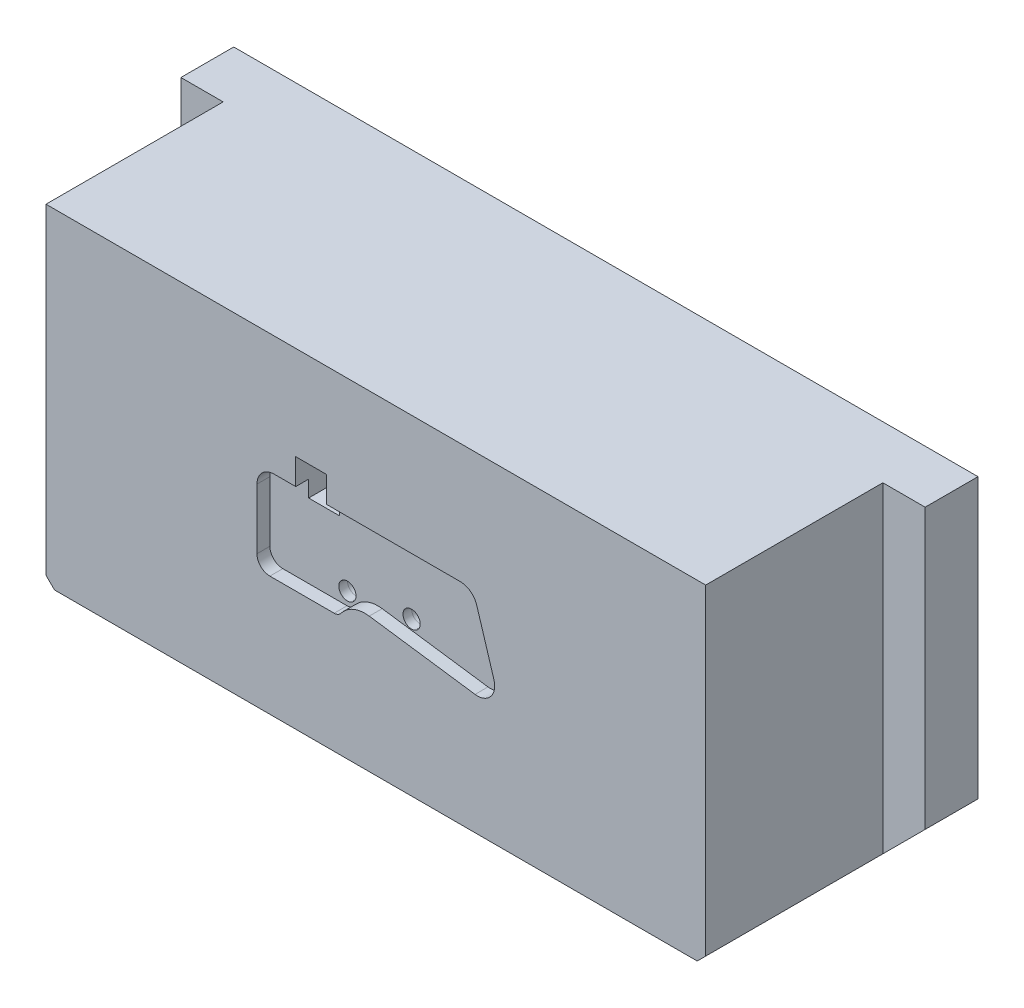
ISO-10303-21;
HEADER;
FILE_DESCRIPTION(('STEP AP214'),'2;1');
FILE_NAME('part.step','',(''),(''),'','','');
FILE_SCHEMA(('AUTOMOTIVE_DESIGN { 1 0 10303 214 1 1 1 1 }'));
ENDSEC;
DATA;
#1=APPLICATION_CONTEXT('core data for automotive mechanical design processes');
#2=APPLICATION_PROTOCOL_DEFINITION('international standard','automotive_design',2000,#1);
#3=PRODUCT_CONTEXT('',#1,'mechanical');
#4=PRODUCT('Part','Part','',(#3));
#5=PRODUCT_RELATED_PRODUCT_CATEGORY('part','',(#4));
#6=PRODUCT_DEFINITION_FORMATION('','',#4);
#7=PRODUCT_DEFINITION_CONTEXT('part definition',#1,'design');
#8=PRODUCT_DEFINITION('design','',#6,#7);
#9=PRODUCT_DEFINITION_SHAPE('','',#8);
#10=(LENGTH_UNIT() NAMED_UNIT(*) SI_UNIT(.MILLI.,.METRE.));
#11=(NAMED_UNIT(*) PLANE_ANGLE_UNIT() SI_UNIT($,.RADIAN.));
#12=(NAMED_UNIT(*) SI_UNIT($,.STERADIAN.) SOLID_ANGLE_UNIT());
#13=UNCERTAINTY_MEASURE_WITH_UNIT(LENGTH_MEASURE(1.E-05),#10,'distance_accuracy_value','');
#14=(GEOMETRIC_REPRESENTATION_CONTEXT(3) GLOBAL_UNCERTAINTY_ASSIGNED_CONTEXT((#13)) GLOBAL_UNIT_ASSIGNED_CONTEXT((#10,
#11,#12)) REPRESENTATION_CONTEXT('',''));
#15=CARTESIAN_POINT('',(0.,0.,0.));
#16=DIRECTION('',(0.,0.,1.));
#17=DIRECTION('',(1.,0.,0.));
#18=AXIS2_PLACEMENT_3D('',#15,#16,#17);
#19=CARTESIAN_POINT('',(-4.8888,-3.819375,-27.2));
#20=DIRECTION('',(0.,0.,1.));
#21=DIRECTION('',(1.,0.,0.));
#22=AXIS2_PLACEMENT_3D('',#19,#20,#21);
#23=CYLINDRICAL_SURFACE('',#22,1.00961168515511);
#24=CARTESIAN_POINT('',(-4.8888,-3.819375,-8.54625));
#25=DIRECTION('',(0.,0.,1.));
#26=DIRECTION('',(1.,0.,0.));
#27=AXIS2_PLACEMENT_3D('',#24,#25,#26);
#28=CIRCLE('',#27,1.00961168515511);
#29=CARTESIAN_POINT('',(-3.87918831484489,-3.819375,-8.54625));
#30=VERTEX_POINT('',#29);
#31=EDGE_CURVE('E33',#30,#30,#28,.F.);
#32=ORIENTED_EDGE('',*,*,#31,.T.);
#33=EDGE_LOOP('',(#32));
#34=FACE_BOUND('',#33,.T.);
#35=CARTESIAN_POINT('',(-4.8888,-3.819375,-2.54625));
#36=DIRECTION('',(0.,0.,1.));
#37=DIRECTION('',(1.,0.,0.));
#38=AXIS2_PLACEMENT_3D('',#35,#36,#37);
#39=CIRCLE('',#38,1.00961168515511);
#40=CARTESIAN_POINT('',(-3.87918831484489,-3.819375,-2.54625));
#41=VERTEX_POINT('',#40);
#42=EDGE_CURVE('E330',#41,#41,#39,.T.);
#43=ORIENTED_EDGE('',*,*,#42,.T.);
#44=EDGE_LOOP('',(#43));
#45=FACE_BOUND('',#44,.T.);
#46=ADVANCED_FACE('F29',(#34,#45),#23,.F.);
#47=CARTESIAN_POINT('',(2.699025,-2.902725,-27.2));
#48=DIRECTION('',(0.,0.,1.));
#49=DIRECTION('',(1.,0.,0.));
#50=AXIS2_PLACEMENT_3D('',#47,#48,#49);
#51=CYLINDRICAL_SURFACE('',#50,1.00961168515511);
#52=CARTESIAN_POINT('',(2.699025,-2.902725,-8.54625));
#53=DIRECTION('',(0.,0.,1.));
#54=DIRECTION('',(1.,0.,0.));
#55=AXIS2_PLACEMENT_3D('',#52,#53,#54);
#56=CIRCLE('',#55,1.00961168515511);
#57=CARTESIAN_POINT('',(3.70863668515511,-2.902725,-8.54625));
#58=VERTEX_POINT('',#57);
#59=EDGE_CURVE('E277',#58,#58,#56,.F.);
#60=ORIENTED_EDGE('',*,*,#59,.T.);
#61=EDGE_LOOP('',(#60));
#62=FACE_BOUND('',#61,.T.);
#63=CARTESIAN_POINT('',(2.699025,-2.902725,-2.54624999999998));
#64=DIRECTION('',(0.,0.,1.));
#65=DIRECTION('',(1.,0.,0.));
#66=AXIS2_PLACEMENT_3D('',#63,#64,#65);
#67=CIRCLE('',#66,1.00961168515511);
#68=CARTESIAN_POINT('',(3.70863668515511,-2.902725,-2.54624999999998));
#69=VERTEX_POINT('',#68);
#70=EDGE_CURVE('E327',#69,#69,#67,.T.);
#71=ORIENTED_EDGE('',*,*,#70,.T.);
#72=EDGE_LOOP('',(#71));
#73=FACE_BOUND('',#72,.T.);
#74=ADVANCED_FACE('F617',(#62,#73),#51,.F.);
#75=CARTESIAN_POINT('',(9.9813,3.310125,-1.52775));
#76=DIRECTION('',(0.,0.,1.));
#77=DIRECTION('',(1.,0.,0.));
#78=AXIS2_PLACEMENT_3D('',#75,#76,#77);
#79=PLANE('',#78);
#80=CARTESIAN_POINT('',(-4.8888,-3.819375,-1.52775));
#81=DIRECTION('',(0.,0.,1.));
#82=DIRECTION('',(1.,0.,0.));
#83=AXIS2_PLACEMENT_3D('',#80,#81,#82);
#84=CIRCLE('',#83,1.0185);
#85=CARTESIAN_POINT('',(-3.8703,-3.819375,-1.52775));
#86=VERTEX_POINT('',#85);
#87=EDGE_CURVE('E354',#86,#86,#84,.F.);
#88=ORIENTED_EDGE('',*,*,#87,.T.);
#89=EDGE_LOOP('',(#88));
#90=FACE_BOUND('',#89,.T.);
#91=DIRECTION('',(0.990268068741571,-0.139173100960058,0.));
#92=VECTOR('',#91,1.);
#93=CARTESIAN_POINT('',(11.7348043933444,-5.32730105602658,-1.52775));
#94=LINE('',#93,#92);
#95=CARTESIAN_POINT('',(-0.778691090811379,-3.56864395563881,-1.52775));
#96=VERTEX_POINT('',#95);
#97=CARTESIAN_POINT('',(11.7348043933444,-5.32730105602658,-1.52775));
#98=VERTEX_POINT('',#97);
#99=EDGE_CURVE('E395',#96,#98,#94,.T.);
#100=ORIENTED_EDGE('',*,*,#99,.T.);
#101=CARTESIAN_POINT('',(12.0183,-3.310125,-1.52775));
#102=DIRECTION('',(0.,0.,1.));
#103=DIRECTION('',(1.,0.,0.));
#104=AXIS2_PLACEMENT_3D('',#101,#102,#103);
#105=CIRCLE('',#104,2.037);
#106=CARTESIAN_POINT('',(13.9652218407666,-2.71107212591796,-1.52775));
#107=VERTEX_POINT('',#106);
#108=EDGE_CURVE('E403',#98,#107,#105,.T.);
#109=ORIENTED_EDGE('',*,*,#108,.T.);
#110=DIRECTION('',(-0.294085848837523,0.95577900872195,0.));
#111=VECTOR('',#110,1.);
#112=CARTESIAN_POINT('',(11.9282218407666,3.90917787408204,-1.52775));
#113=LINE('',#112,#111);
#114=CARTESIAN_POINT('',(11.9282218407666,3.90917787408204,-1.52775));
#115=VERTEX_POINT('',#114);
#116=EDGE_CURVE('E370',#107,#115,#113,.T.);
#117=ORIENTED_EDGE('',*,*,#116,.T.);
#118=CARTESIAN_POINT('',(9.9813,3.310125,-1.52775));
#119=DIRECTION('',(0.,0.,1.));
#120=DIRECTION('',(1.,0.,0.));
#121=AXIS2_PLACEMENT_3D('',#118,#119,#120);
#122=CIRCLE('',#121,2.037);
#123=CARTESIAN_POINT('',(9.9813,5.347125,-1.52775));
#124=VERTEX_POINT('',#123);
#125=EDGE_CURVE('E366',#115,#124,#122,.T.);
#126=ORIENTED_EDGE('',*,*,#125,.T.);
#127=DIRECTION('',(-1.,0.,0.));
#128=VECTOR('',#127,1.);
#129=CARTESIAN_POINT('',(-5.80545,5.347125,-1.52775));
#130=LINE('',#129,#128);
#131=CARTESIAN_POINT('',(-5.80545,5.347125,-1.52775));
#132=VERTEX_POINT('',#131);
#133=EDGE_CURVE('E369',#124,#132,#130,.T.);
#134=ORIENTED_EDGE('',*,*,#133,.T.);
#135=DIRECTION('',(0.,-1.,0.));
#136=VECTOR('',#135,1.);
#137=CARTESIAN_POINT('',(-5.80545,3.411975,-1.52775));
#138=LINE('',#137,#136);
#139=CARTESIAN_POINT('',(-5.80545,3.411975,-1.52775));
#140=VERTEX_POINT('',#139);
#141=EDGE_CURVE('E373',#132,#140,#138,.T.);
#142=ORIENTED_EDGE('',*,*,#141,.T.);
#143=DIRECTION('',(-1.,0.,0.));
#144=VECTOR('',#143,1.);
#145=CARTESIAN_POINT('',(-9.47205,3.411975,-1.52775));
#146=LINE('',#145,#144);
#147=CARTESIAN_POINT('',(-9.47205,3.411975,-1.52775));
#148=VERTEX_POINT('',#147);
#149=EDGE_CURVE('E376',#140,#148,#146,.T.);
#150=ORIENTED_EDGE('',*,*,#149,.T.);
#151=DIRECTION('',(0.,1.,0.));
#152=VECTOR('',#151,1.);
#153=CARTESIAN_POINT('',(-9.47205,5.347125,-1.52775));
#154=LINE('',#153,#152);
#155=CARTESIAN_POINT('',(-9.47205,5.347125,-1.52775));
#156=VERTEX_POINT('',#155);
#157=EDGE_CURVE('E379',#148,#156,#154,.T.);
#158=ORIENTED_EDGE('',*,*,#157,.T.);
#159=DIRECTION('',(-1.,0.,0.));
#160=VECTOR('',#159,1.);
#161=CARTESIAN_POINT('',(-12.0183,5.347125,-1.52775));
#162=LINE('',#161,#160);
#163=CARTESIAN_POINT('',(-12.0183,5.347125,-1.52775));
#164=VERTEX_POINT('',#163);
#165=EDGE_CURVE('E382',#156,#164,#162,.T.);
#166=ORIENTED_EDGE('',*,*,#165,.T.);
#167=CARTESIAN_POINT('',(-12.0183,3.310125,-1.52775));
#168=DIRECTION('',(0.,0.,1.));
#169=DIRECTION('',(1.,0.,0.));
#170=AXIS2_PLACEMENT_3D('',#167,#168,#169);
#171=CIRCLE('',#170,2.037);
#172=CARTESIAN_POINT('',(-14.0553,3.310125,-1.52775));
#173=VERTEX_POINT('',#172);
#174=EDGE_CURVE('E384',#164,#173,#171,.T.);
#175=ORIENTED_EDGE('',*,*,#174,.T.);
#176=DIRECTION('',(0.,-1.,0.));
#177=VECTOR('',#176,1.);
#178=CARTESIAN_POINT('',(-14.0553,3.310125,-1.52775));
#179=LINE('',#178,#177);
#180=CARTESIAN_POINT('',(-14.0553,-3.819375,-1.52775));
#181=VERTEX_POINT('',#180);
#182=EDGE_CURVE('E386',#173,#181,#179,.T.);
#183=ORIENTED_EDGE('',*,*,#182,.T.);
#184=CARTESIAN_POINT('',(-12.52755,-3.819375,-1.52775));
#185=DIRECTION('',(0.,0.,1.));
#186=DIRECTION('',(1.,0.,0.));
#187=AXIS2_PLACEMENT_3D('',#184,#185,#186);
#188=CIRCLE('',#187,1.52775);
#189=CARTESIAN_POINT('',(-12.52755,-5.347125,-1.52775));
#190=VERTEX_POINT('',#189);
#191=EDGE_CURVE('E388',#181,#190,#188,.T.);
#192=ORIENTED_EDGE('',*,*,#191,.T.);
#193=DIRECTION('',(1.,0.,0.));
#194=VECTOR('',#193,1.);
#195=CARTESIAN_POINT('',(-12.52755,-5.347125,-1.52775));
#196=LINE('',#195,#194);
#197=CARTESIAN_POINT('',(-4.9262264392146,-5.347125,-1.52775));
#198=VERTEX_POINT('',#197);
#199=EDGE_CURVE('E392',#190,#198,#196,.T.);
#200=ORIENTED_EDGE('',*,*,#199,.T.);
#201=CARTESIAN_POINT('',(-4.9262264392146,-4.328625,-1.52775));
#202=DIRECTION('',(0.,0.,1.));
#203=DIRECTION('',(1.,0.,0.));
#204=AXIS2_PLACEMENT_3D('',#201,#202,#203);
#205=CIRCLE('',#204,1.0185);
#206=CARTESIAN_POINT('',(-4.11480020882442,-4.94419767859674,-1.52775));
#207=VERTEX_POINT('',#206);
#208=EDGE_CURVE('E394',#198,#207,#205,.T.);
#209=ORIENTED_EDGE('',*,*,#208,.T.);
#210=CARTESIAN_POINT('',(-1.27480840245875,-7.09870205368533,-1.52775));
#211=DIRECTION('',(0.,0.,-1.));
#212=DIRECTION('',(1.,0.,0.));
#213=AXIS2_PLACEMENT_3D('',#210,#211,#212);
#214=CIRCLE('',#213,3.56475);
#215=EDGE_CURVE('E398',#207,#96,#214,.T.);
#216=ORIENTED_EDGE('',*,*,#215,.T.);
#217=EDGE_LOOP('',(#100,#109,#117,#126,#134,#142,#150,#158,#166,#175,#183,#192,#200,#209,#216));
#218=FACE_BOUND('',#217,.T.);
#219=CARTESIAN_POINT('',(2.699025,-2.902725,-1.52775));
#220=DIRECTION('',(0.,0.,1.));
#221=DIRECTION('',(1.,0.,0.));
#222=AXIS2_PLACEMENT_3D('',#219,#220,#221);
#223=CIRCLE('',#222,1.0185);
#224=CARTESIAN_POINT('',(3.717525,-2.902725,-1.52775));
#225=VERTEX_POINT('',#224);
#226=EDGE_CURVE('E391',#225,#225,#223,.F.);
#227=ORIENTED_EDGE('',*,*,#226,.T.);
#228=EDGE_LOOP('',(#227));
#229=FACE_BOUND('',#228,.T.);
#230=ADVANCED_FACE('F623',(#90,#218,#229),#79,.T.);
#231=CARTESIAN_POINT('',(-12.52755,-5.347125,0.));
#232=DIRECTION('',(0.,1.,0.));
#233=DIRECTION('',(-1.,0.,0.));
#234=AXIS2_PLACEMENT_3D('',#231,#232,#233);
#235=PLANE('',#234);
#236=DIRECTION('',(1.,0.,0.));
#237=VECTOR('',#236,1.);
#238=CARTESIAN_POINT('',(-12.52755,-5.347125,0.));
#239=LINE('',#238,#237);
#240=CARTESIAN_POINT('',(-12.52755,-5.347125,0.));
#241=VERTEX_POINT('',#240);
#242=CARTESIAN_POINT('',(-4.9262264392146,-5.347125,0.));
#243=VERTEX_POINT('',#242);
#244=EDGE_CURVE('E424',#241,#243,#239,.T.);
#245=ORIENTED_EDGE('',*,*,#244,.T.);
#246=DIRECTION('',(0.,0.,-1.));
#247=VECTOR('',#246,1.);
#248=CARTESIAN_POINT('',(-4.9262264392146,-5.347125,0.));
#249=LINE('',#248,#247);
#250=EDGE_CURVE('E401',#243,#198,#249,.T.);
#251=ORIENTED_EDGE('',*,*,#250,.T.);
#252=ORIENTED_EDGE('',*,*,#199,.F.);
#253=DIRECTION('',(0.,0.,-1.));
#254=VECTOR('',#253,1.);
#255=CARTESIAN_POINT('',(-12.52755,-5.347125,0.));
#256=LINE('',#255,#254);
#257=EDGE_CURVE('E420',#241,#190,#256,.T.);
#258=ORIENTED_EDGE('',*,*,#257,.F.);
#259=EDGE_LOOP('',(#245,#251,#252,#258));
#260=FACE_BOUND('',#259,.T.);
#261=ADVANCED_FACE('F658',(#260),#235,.T.);
#262=CARTESIAN_POINT('',(11.7348043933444,-5.32730105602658,0.));
#263=DIRECTION('',(0.139173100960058,0.990268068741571,0.));
#264=DIRECTION('',(-0.990268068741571,0.139173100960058,0.));
#265=AXIS2_PLACEMENT_3D('',#262,#263,#264);
#266=PLANE('',#265);
#267=DIRECTION('',(0.,0.,-1.));
#268=VECTOR('',#267,1.);
#269=CARTESIAN_POINT('',(-0.778691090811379,-3.56864395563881,0.));
#270=LINE('',#269,#268);
#271=CARTESIAN_POINT('',(-0.778691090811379,-3.56864395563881,0.));
#272=VERTEX_POINT('',#271);
#273=EDGE_CURVE('E443',#272,#96,#270,.T.);
#274=ORIENTED_EDGE('',*,*,#273,.F.);
#275=DIRECTION('',(0.990268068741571,-0.139173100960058,0.));
#276=VECTOR('',#275,1.);
#277=CARTESIAN_POINT('',(11.7348043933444,-5.32730105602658,0.));
#278=LINE('',#277,#276);
#279=CARTESIAN_POINT('',(11.7348043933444,-5.32730105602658,0.));
#280=VERTEX_POINT('',#279);
#281=EDGE_CURVE('E428',#272,#280,#278,.T.);
#282=ORIENTED_EDGE('',*,*,#281,.T.);
#283=DIRECTION('',(0.,0.,-1.));
#284=VECTOR('',#283,1.);
#285=CARTESIAN_POINT('',(11.7348043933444,-5.32730105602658,0.));
#286=LINE('',#285,#284);
#287=EDGE_CURVE('E416',#280,#98,#286,.T.);
#288=ORIENTED_EDGE('',*,*,#287,.T.);
#289=ORIENTED_EDGE('',*,*,#99,.F.);
#290=EDGE_LOOP('',(#274,#282,#288,#289));
#291=FACE_BOUND('',#290,.T.);
#292=ADVANCED_FACE('F646',(#291),#266,.T.);
#293=CARTESIAN_POINT('',(-39.,19.5,0.));
#294=DIRECTION('',(0.,0.,-1.));
#295=DIRECTION('',(-1.,0.,0.));
#296=AXIS2_PLACEMENT_3D('',#293,#294,#295);
#297=PLANE('',#296);
#298=DIRECTION('',(-1.,0.,0.));
#299=VECTOR('',#298,1.);
#300=CARTESIAN_POINT('',(-39.,19.5,0.));
#301=LINE('',#300,#299);
#302=CARTESIAN_POINT('',(39.,19.5,0.));
#303=VERTEX_POINT('',#302);
#304=CARTESIAN_POINT('',(-39.,19.5,0.));
#305=VERTEX_POINT('',#304);
#306=EDGE_CURVE('E449',#303,#305,#301,.T.);
#307=ORIENTED_EDGE('',*,*,#306,.T.);
#308=DIRECTION('',(0.,-1.,0.));
#309=VECTOR('',#308,1.);
#310=CARTESIAN_POINT('',(-39.,19.5,0.));
#311=LINE('',#310,#309);
#312=CARTESIAN_POINT('',(-39.,-18.5,0.));
#313=VERTEX_POINT('',#312);
#314=EDGE_CURVE('E732',#305,#313,#311,.T.);
#315=ORIENTED_EDGE('',*,*,#314,.T.);
#316=DIRECTION('',(0.707106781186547,-0.707106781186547,0.));
#317=VECTOR('',#316,1.);
#318=CARTESIAN_POINT('',(-39.,-18.5,0.));
#319=LINE('',#318,#317);
#320=CARTESIAN_POINT('',(-38.,-19.5,0.));
#321=VERTEX_POINT('',#320);
#322=EDGE_CURVE('E738',#313,#321,#319,.T.);
#323=ORIENTED_EDGE('',*,*,#322,.T.);
#324=DIRECTION('',(1.,0.,0.));
#325=VECTOR('',#324,1.);
#326=CARTESIAN_POINT('',(-38.,-19.5,0.));
#327=LINE('',#326,#325);
#328=CARTESIAN_POINT('',(38.,-19.5,0.));
#329=VERTEX_POINT('',#328);
#330=EDGE_CURVE('E743',#321,#329,#327,.T.);
#331=ORIENTED_EDGE('',*,*,#330,.T.);
#332=DIRECTION('',(0.707106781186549,0.707106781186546,0.));
#333=VECTOR('',#332,1.);
#334=CARTESIAN_POINT('',(39.,-18.5,0.));
#335=LINE('',#334,#333);
#336=CARTESIAN_POINT('',(39.,-18.5,0.));
#337=VERTEX_POINT('',#336);
#338=EDGE_CURVE('E746',#329,#337,#335,.T.);
#339=ORIENTED_EDGE('',*,*,#338,.T.);
#340=DIRECTION('',(0.,1.,0.));
#341=VECTOR('',#340,1.);
#342=CARTESIAN_POINT('',(39.,19.5,0.));
#343=LINE('',#342,#341);
#344=EDGE_CURVE('E545',#337,#303,#343,.T.);
#345=ORIENTED_EDGE('',*,*,#344,.T.);
#346=EDGE_LOOP('',(#307,#315,#323,#331,#339,#345));
#347=FACE_BOUND('',#346,.T.);
#348=DIRECTION('',(-1.,0.,0.));
#349=VECTOR('',#348,1.);
#350=CARTESIAN_POINT('',(-5.80545,8.411975,0.));
#351=LINE('',#350,#349);
#352=CARTESIAN_POINT('',(-5.80545,8.411975,0.));
#353=VERTEX_POINT('',#352);
#354=CARTESIAN_POINT('',(-9.47205,8.411975,0.));
#355=VERTEX_POINT('',#354);
#356=EDGE_CURVE('E335',#353,#355,#351,.T.);
#357=ORIENTED_EDGE('',*,*,#356,.F.);
#358=DIRECTION('',(0.,1.,0.));
#359=VECTOR('',#358,1.);
#360=CARTESIAN_POINT('',(-5.80545,8.411975,0.));
#361=LINE('',#360,#359);
#362=CARTESIAN_POINT('',(-5.80545,5.347125,0.));
#363=VERTEX_POINT('',#362);
#364=EDGE_CURVE('E333',#363,#353,#361,.T.);
#365=ORIENTED_EDGE('',*,*,#364,.F.);
#366=DIRECTION('',(1.,0.,0.));
#367=VECTOR('',#366,1.);
#368=CARTESIAN_POINT('',(-14.0553,5.347125,0.));
#369=LINE('',#368,#367);
#370=CARTESIAN_POINT('',(9.9813,5.347125,0.));
#371=VERTEX_POINT('',#370);
#372=EDGE_CURVE('E362',#363,#371,#369,.T.);
#373=ORIENTED_EDGE('',*,*,#372,.T.);
#374=CARTESIAN_POINT('',(9.9813,3.310125,0.));
#375=DIRECTION('',(0.,0.,1.));
#376=DIRECTION('',(1.,0.,0.));
#377=AXIS2_PLACEMENT_3D('',#374,#375,#376);
#378=CIRCLE('',#377,2.037);
#379=CARTESIAN_POINT('',(11.9282218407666,3.90917787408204,0.));
#380=VERTEX_POINT('',#379);
#381=EDGE_CURVE('E407',#380,#371,#378,.T.);
#382=ORIENTED_EDGE('',*,*,#381,.F.);
#383=DIRECTION('',(-0.294085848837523,0.95577900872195,0.));
#384=VECTOR('',#383,1.);
#385=CARTESIAN_POINT('',(11.9282218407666,3.90917787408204,0.));
#386=LINE('',#385,#384);
#387=CARTESIAN_POINT('',(13.9652218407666,-2.71107212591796,0.));
#388=VERTEX_POINT('',#387);
#389=EDGE_CURVE('E435',#388,#380,#386,.T.);
#390=ORIENTED_EDGE('',*,*,#389,.F.);
#391=CARTESIAN_POINT('',(12.0183,-3.310125,0.));
#392=DIRECTION('',(0.,0.,1.));
#393=DIRECTION('',(1.,0.,0.));
#394=AXIS2_PLACEMENT_3D('',#391,#392,#393);
#395=CIRCLE('',#394,2.037);
#396=EDGE_CURVE('E430',#280,#388,#395,.T.);
#397=ORIENTED_EDGE('',*,*,#396,.F.);
#398=ORIENTED_EDGE('',*,*,#281,.F.);
#399=CARTESIAN_POINT('',(-1.27480840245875,-7.09870205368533,0.));
#400=DIRECTION('',(0.,0.,-1.));
#401=DIRECTION('',(1.,0.,0.));
#402=AXIS2_PLACEMENT_3D('',#399,#400,#401);
#403=CIRCLE('',#402,3.56475);
#404=CARTESIAN_POINT('',(-4.11480020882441,-4.94419767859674,0.));
#405=VERTEX_POINT('',#404);
#406=EDGE_CURVE('E555',#405,#272,#403,.T.);
#407=ORIENTED_EDGE('',*,*,#406,.F.);
#408=CARTESIAN_POINT('',(-4.9262264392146,-4.328625,0.));
#409=DIRECTION('',(0.,0.,1.));
#410=DIRECTION('',(1.,0.,0.));
#411=AXIS2_PLACEMENT_3D('',#408,#409,#410);
#412=CIRCLE('',#411,1.0185);
#413=EDGE_CURVE('E460',#243,#405,#412,.T.);
#414=ORIENTED_EDGE('',*,*,#413,.F.);
#415=ORIENTED_EDGE('',*,*,#244,.F.);
#416=CARTESIAN_POINT('',(-12.52755,-3.819375,0.));
#417=DIRECTION('',(0.,0.,1.));
#418=DIRECTION('',(1.,0.,0.));
#419=AXIS2_PLACEMENT_3D('',#416,#417,#418);
#420=CIRCLE('',#419,1.52775);
#421=CARTESIAN_POINT('',(-14.0553,-3.819375,0.));
#422=VERTEX_POINT('',#421);
#423=EDGE_CURVE('E421',#422,#241,#420,.T.);
#424=ORIENTED_EDGE('',*,*,#423,.F.);
#425=DIRECTION('',(0.,-1.,0.));
#426=VECTOR('',#425,1.);
#427=CARTESIAN_POINT('',(-14.0553,3.310125,0.));
#428=LINE('',#427,#426);
#429=CARTESIAN_POINT('',(-14.0553,3.310125,0.));
#430=VERTEX_POINT('',#429);
#431=EDGE_CURVE('E417',#430,#422,#428,.T.);
#432=ORIENTED_EDGE('',*,*,#431,.F.);
#433=CARTESIAN_POINT('',(-12.0183,3.310125,0.));
#434=DIRECTION('',(0.,0.,1.));
#435=DIRECTION('',(1.,0.,0.));
#436=AXIS2_PLACEMENT_3D('',#433,#434,#435);
#437=CIRCLE('',#436,2.037);
#438=CARTESIAN_POINT('',(-12.0183,5.347125,0.));
#439=VERTEX_POINT('',#438);
#440=EDGE_CURVE('E412',#439,#430,#437,.T.);
#441=ORIENTED_EDGE('',*,*,#440,.F.);
#442=CARTESIAN_POINT('',(-9.47205,5.347125,0.));
#443=VERTEX_POINT('',#442);
#444=EDGE_CURVE('E365',#439,#443,#369,.T.);
#445=ORIENTED_EDGE('',*,*,#444,.T.);
#446=DIRECTION('',(0.,-1.,0.));
#447=VECTOR('',#446,1.);
#448=CARTESIAN_POINT('',(-9.47205,3.411975,0.));
#449=LINE('',#448,#447);
#450=EDGE_CURVE('E338',#355,#443,#449,.T.);
#451=ORIENTED_EDGE('',*,*,#450,.F.);
#452=EDGE_LOOP('',(#357,#365,#373,#382,#390,#397,#398,#407,#414,#415,#424,#432,#441,#445,#451));
#453=FACE_BOUND('',#452,.T.);
#454=ADVANCED_FACE('F643',(#347,#453),#297,.F.);
#455=CARTESIAN_POINT('',(-39.,19.5,-20.95));
#456=DIRECTION('',(0.,1.,0.));
#457=DIRECTION('',(0.,0.,1.));
#458=AXIS2_PLACEMENT_3D('',#455,#456,#457);
#459=PLANE('',#458);
#460=ORIENTED_EDGE('',*,*,#306,.F.);
#461=DIRECTION('',(0.,0.,1.));
#462=VECTOR('',#461,1.);
#463=CARTESIAN_POINT('',(39.,19.5,-20.95));
#464=LINE('',#463,#462);
#465=CARTESIAN_POINT('',(39.,19.5,-20.95));
#466=VERTEX_POINT('',#465);
#467=EDGE_CURVE('E517',#466,#303,#464,.T.);
#468=ORIENTED_EDGE('',*,*,#467,.F.);
#469=DIRECTION('',(1.,0.,0.));
#470=VECTOR('',#469,1.);
#471=CARTESIAN_POINT('',(-44.,19.5,-20.95));
#472=LINE('',#471,#470);
#473=CARTESIAN_POINT('',(44.,19.5,-20.95));
#474=VERTEX_POINT('',#473);
#475=EDGE_CURVE('E364',#466,#474,#472,.T.);
#476=ORIENTED_EDGE('',*,*,#475,.T.);
#477=DIRECTION('',(0.,0.,1.));
#478=VECTOR('',#477,1.);
#479=CARTESIAN_POINT('',(44.,19.5,-27.2));
#480=LINE('',#479,#478);
#481=CARTESIAN_POINT('',(44.,19.5,-27.2));
#482=VERTEX_POINT('',#481);
#483=EDGE_CURVE('E502',#482,#474,#480,.T.);
#484=ORIENTED_EDGE('',*,*,#483,.F.);
#485=DIRECTION('',(1.,0.,0.));
#486=VECTOR('',#485,1.);
#487=CARTESIAN_POINT('',(-44.,19.5,-27.2));
#488=LINE('',#487,#486);
#489=CARTESIAN_POINT('',(-44.,19.5,-27.2));
#490=VERTEX_POINT('',#489);
#491=EDGE_CURVE('E501',#490,#482,#488,.T.);
#492=ORIENTED_EDGE('',*,*,#491,.F.);
#493=DIRECTION('',(0.,0.,1.));
#494=VECTOR('',#493,1.);
#495=CARTESIAN_POINT('',(-44.,19.5,-27.2));
#496=LINE('',#495,#494);
#497=CARTESIAN_POINT('',(-44.,19.5,-20.95));
#498=VERTEX_POINT('',#497);
#499=EDGE_CURVE('E486',#490,#498,#496,.T.);
#500=ORIENTED_EDGE('',*,*,#499,.T.);
#501=CARTESIAN_POINT('',(-39.,19.5,-20.95));
#502=VERTEX_POINT('',#501);
#503=EDGE_CURVE('E482',#498,#502,#472,.T.);
#504=ORIENTED_EDGE('',*,*,#503,.T.);
#505=DIRECTION('',(0.,0.,1.));
#506=VECTOR('',#505,1.);
#507=CARTESIAN_POINT('',(-39.,19.5,-20.95));
#508=LINE('',#507,#506);
#509=EDGE_CURVE('E485',#502,#305,#508,.T.);
#510=ORIENTED_EDGE('',*,*,#509,.T.);
#511=EDGE_LOOP('',(#460,#468,#476,#484,#492,#500,#504,#510));
#512=FACE_BOUND('',#511,.T.);
#513=ADVANCED_FACE('F31',(#512),#459,.T.);
#514=CARTESIAN_POINT('',(39.,19.5,-20.95));
#515=DIRECTION('',(1.,0.,0.));
#516=DIRECTION('',(0.,1.,0.));
#517=AXIS2_PLACEMENT_3D('',#514,#515,#516);
#518=PLANE('',#517);
#519=ORIENTED_EDGE('',*,*,#344,.F.);
#520=DIRECTION('',(0.,0.,1.));
#521=VECTOR('',#520,1.);
#522=CARTESIAN_POINT('',(39.,-18.5,-20.95));
#523=LINE('',#522,#521);
#524=CARTESIAN_POINT('',(39.,-18.5,-20.95));
#525=VERTEX_POINT('',#524);
#526=EDGE_CURVE('E490',#525,#337,#523,.T.);
#527=ORIENTED_EDGE('',*,*,#526,.F.);
#528=DIRECTION('',(0.,1.,0.));
#529=VECTOR('',#528,1.);
#530=CARTESIAN_POINT('',(39.,19.5,-20.95));
#531=LINE('',#530,#529);
#532=EDGE_CURVE('E534',#525,#466,#531,.T.);
#533=ORIENTED_EDGE('',*,*,#532,.T.);
#534=ORIENTED_EDGE('',*,*,#467,.T.);
#535=EDGE_LOOP('',(#519,#527,#533,#534));
#536=FACE_BOUND('',#535,.T.);
#537=ADVANCED_FACE('F543',(#536),#518,.T.);
#538=CARTESIAN_POINT('',(39.,-18.5,-20.95));
#539=DIRECTION('',(0.707106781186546,-0.707106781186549,0.));
#540=DIRECTION('',(0.707106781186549,0.707106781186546,0.));
#541=AXIS2_PLACEMENT_3D('',#538,#539,#540);
#542=PLANE('',#541);
#543=ORIENTED_EDGE('',*,*,#338,.F.);
#544=DIRECTION('',(0.,0.,1.));
#545=VECTOR('',#544,1.);
#546=CARTESIAN_POINT('',(38.,-19.5,-20.95));
#547=LINE('',#546,#545);
#548=CARTESIAN_POINT('',(38.,-19.5,-27.2));
#549=VERTEX_POINT('',#548);
#550=EDGE_CURVE('E546',#549,#329,#547,.T.);
#551=ORIENTED_EDGE('',*,*,#550,.F.);
#552=DIRECTION('',(-0.707106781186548,-0.707106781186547,0.));
#553=VECTOR('',#552,1.);
#554=CARTESIAN_POINT('',(44.,-13.5,-27.2));
#555=LINE('',#554,#553);
#556=CARTESIAN_POINT('',(44.,-13.5,-27.2));
#557=VERTEX_POINT('',#556);
#558=EDGE_CURVE('E506',#557,#549,#555,.T.);
#559=ORIENTED_EDGE('',*,*,#558,.F.);
#560=DIRECTION('',(0.,0.,1.));
#561=VECTOR('',#560,1.);
#562=CARTESIAN_POINT('',(44.,-13.5,-27.2));
#563=LINE('',#562,#561);
#564=CARTESIAN_POINT('',(44.,-13.5,-20.95));
#565=VERTEX_POINT('',#564);
#566=EDGE_CURVE('E491',#557,#565,#563,.T.);
#567=ORIENTED_EDGE('',*,*,#566,.T.);
#568=DIRECTION('',(-0.707106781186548,-0.707106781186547,0.));
#569=VECTOR('',#568,1.);
#570=CARTESIAN_POINT('',(44.,-13.5,-20.95));
#571=LINE('',#570,#569);
#572=EDGE_CURVE('E487',#565,#525,#571,.T.);
#573=ORIENTED_EDGE('',*,*,#572,.T.);
#574=ORIENTED_EDGE('',*,*,#526,.T.);
#575=EDGE_LOOP('',(#543,#551,#559,#567,#573,#574));
#576=FACE_BOUND('',#575,.T.);
#577=ADVANCED_FACE('F538',(#576),#542,.T.);
#578=CARTESIAN_POINT('',(-38.,-19.5,-20.95));
#579=DIRECTION('',(0.,-1.,0.));
#580=DIRECTION('',(1.,0.,0.));
#581=AXIS2_PLACEMENT_3D('',#578,#579,#580);
#582=PLANE('',#581);
#583=ORIENTED_EDGE('',*,*,#330,.F.);
#584=DIRECTION('',(0.,0.,1.));
#585=VECTOR('',#584,1.);
#586=CARTESIAN_POINT('',(-38.,-19.5,-20.95));
#587=LINE('',#586,#585);
#588=CARTESIAN_POINT('',(-38.,-19.5,-27.2));
#589=VERTEX_POINT('',#588);
#590=EDGE_CURVE('E755',#589,#321,#587,.T.);
#591=ORIENTED_EDGE('',*,*,#590,.F.);
#592=DIRECTION('',(-1.,0.,0.));
#593=VECTOR('',#592,1.);
#594=CARTESIAN_POINT('',(-38.,-19.5,-27.2));
#595=LINE('',#594,#593);
#596=EDGE_CURVE('E509',#549,#589,#595,.T.);
#597=ORIENTED_EDGE('',*,*,#596,.F.);
#598=ORIENTED_EDGE('',*,*,#550,.T.);
#599=EDGE_LOOP('',(#583,#591,#597,#598));
#600=FACE_BOUND('',#599,.T.);
#601=ADVANCED_FACE('F718',(#600),#582,.T.);
#602=CARTESIAN_POINT('',(-39.,-18.5,-20.95));
#603=DIRECTION('',(-0.707106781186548,-0.707106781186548,0.));
#604=DIRECTION('',(0.707106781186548,-0.707106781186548,0.));
#605=AXIS2_PLACEMENT_3D('',#602,#603,#604);
#606=PLANE('',#605);
#607=ORIENTED_EDGE('',*,*,#322,.F.);
#608=DIRECTION('',(0.,0.,1.));
#609=VECTOR('',#608,1.);
#610=CARTESIAN_POINT('',(-39.,-18.5,-20.95));
#611=LINE('',#610,#609);
#612=CARTESIAN_POINT('',(-39.,-18.5,-20.95));
#613=VERTEX_POINT('',#612);
#614=EDGE_CURVE('E473',#613,#313,#611,.T.);
#615=ORIENTED_EDGE('',*,*,#614,.F.);
#616=DIRECTION('',(-0.707106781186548,0.707106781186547,0.));
#617=VECTOR('',#616,1.);
#618=CARTESIAN_POINT('',(-44.,-13.5,-20.95));
#619=LINE('',#618,#617);
#620=CARTESIAN_POINT('',(-44.,-13.5,-20.95));
#621=VERTEX_POINT('',#620);
#622=EDGE_CURVE('E492',#613,#621,#619,.T.);
#623=ORIENTED_EDGE('',*,*,#622,.T.);
#624=DIRECTION('',(0.,0.,1.));
#625=VECTOR('',#624,1.);
#626=CARTESIAN_POINT('',(-44.,-13.5,-27.2));
#627=LINE('',#626,#625);
#628=CARTESIAN_POINT('',(-44.,-13.5,-27.2));
#629=VERTEX_POINT('',#628);
#630=EDGE_CURVE('E472',#629,#621,#627,.T.);
#631=ORIENTED_EDGE('',*,*,#630,.F.);
#632=DIRECTION('',(-0.707106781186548,0.707106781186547,0.));
#633=VECTOR('',#632,1.);
#634=CARTESIAN_POINT('',(-44.,-13.5,-27.2));
#635=LINE('',#634,#633);
#636=EDGE_CURVE('E445',#589,#629,#635,.T.);
#637=ORIENTED_EDGE('',*,*,#636,.F.);
#638=ORIENTED_EDGE('',*,*,#590,.T.);
#639=EDGE_LOOP('',(#607,#615,#623,#631,#637,#638));
#640=FACE_BOUND('',#639,.T.);
#641=ADVANCED_FACE('F721',(#640),#606,.T.);
#642=CARTESIAN_POINT('',(-39.,19.5,-20.95));
#643=DIRECTION('',(-1.,0.,0.));
#644=DIRECTION('',(0.,0.,1.));
#645=AXIS2_PLACEMENT_3D('',#642,#643,#644);
#646=PLANE('',#645);
#647=ORIENTED_EDGE('',*,*,#314,.F.);
#648=ORIENTED_EDGE('',*,*,#509,.F.);
#649=DIRECTION('',(0.,-1.,0.));
#650=VECTOR('',#649,1.);
#651=CARTESIAN_POINT('',(-39.,19.5,-20.95));
#652=LINE('',#651,#650);
#653=EDGE_CURVE('E752',#502,#613,#652,.T.);
#654=ORIENTED_EDGE('',*,*,#653,.T.);
#655=ORIENTED_EDGE('',*,*,#614,.T.);
#656=EDGE_LOOP('',(#647,#648,#654,#655));
#657=FACE_BOUND('',#656,.T.);
#658=ADVANCED_FACE('F706',(#657),#646,.T.);
#659=CARTESIAN_POINT('',(-44.,-19.5,-20.95));
#660=DIRECTION('',(0.,0.,1.));
#661=DIRECTION('',(1.,0.,0.));
#662=AXIS2_PLACEMENT_3D('',#659,#660,#661);
#663=PLANE('',#662);
#664=ORIENTED_EDGE('',*,*,#532,.F.);
#665=ORIENTED_EDGE('',*,*,#572,.F.);
#666=DIRECTION('',(0.,-1.,0.));
#667=VECTOR('',#666,1.);
#668=CARTESIAN_POINT('',(44.,19.5,-20.95));
#669=LINE('',#668,#667);
#670=EDGE_CURVE('E476',#474,#565,#669,.T.);
#671=ORIENTED_EDGE('',*,*,#670,.F.);
#672=ORIENTED_EDGE('',*,*,#475,.F.);
#673=EDGE_LOOP('',(#664,#665,#671,#672));
#674=FACE_BOUND('',#673,.T.);
#675=ADVANCED_FACE('F533',(#674),#663,.T.);
#676=ORIENTED_EDGE('',*,*,#653,.F.);
#677=ORIENTED_EDGE('',*,*,#503,.F.);
#678=DIRECTION('',(0.,1.,0.));
#679=VECTOR('',#678,1.);
#680=CARTESIAN_POINT('',(-44.,19.5,-20.95));
#681=LINE('',#680,#679);
#682=EDGE_CURVE('E469',#621,#498,#681,.T.);
#683=ORIENTED_EDGE('',*,*,#682,.F.);
#684=ORIENTED_EDGE('',*,*,#622,.F.);
#685=EDGE_LOOP('',(#676,#677,#683,#684));
#686=FACE_BOUND('',#685,.T.);
#687=ADVANCED_FACE('F705',(#686),#663,.T.);
#688=CARTESIAN_POINT('',(-44.,19.5,-27.2));
#689=DIRECTION('',(1.,0.,0.));
#690=DIRECTION('',(0.,1.,0.));
#691=AXIS2_PLACEMENT_3D('',#688,#689,#690);
#692=PLANE('',#691);
#693=ORIENTED_EDGE('',*,*,#682,.T.);
#694=ORIENTED_EDGE('',*,*,#499,.F.);
#695=DIRECTION('',(0.,1.,0.));
#696=VECTOR('',#695,1.);
#697=CARTESIAN_POINT('',(-44.,19.5,-27.2));
#698=LINE('',#697,#696);
#699=EDGE_CURVE('E498',#629,#490,#698,.T.);
#700=ORIENTED_EDGE('',*,*,#699,.F.);
#701=ORIENTED_EDGE('',*,*,#630,.T.);
#702=EDGE_LOOP('',(#693,#694,#700,#701));
#703=FACE_BOUND('',#702,.T.);
#704=ADVANCED_FACE('F710',(#703),#692,.F.);
#705=CARTESIAN_POINT('',(44.,19.5,-27.2));
#706=DIRECTION('',(-1.,0.,0.));
#707=DIRECTION('',(0.,-1.,0.));
#708=AXIS2_PLACEMENT_3D('',#705,#706,#707);
#709=PLANE('',#708);
#710=ORIENTED_EDGE('',*,*,#670,.T.);
#711=ORIENTED_EDGE('',*,*,#566,.F.);
#712=DIRECTION('',(0.,-1.,0.));
#713=VECTOR('',#712,1.);
#714=CARTESIAN_POINT('',(44.,19.5,-27.2));
#715=LINE('',#714,#713);
#716=EDGE_CURVE('E504',#482,#557,#715,.T.);
#717=ORIENTED_EDGE('',*,*,#716,.F.);
#718=ORIENTED_EDGE('',*,*,#483,.T.);
#719=EDGE_LOOP('',(#710,#711,#717,#718));
#720=FACE_BOUND('',#719,.T.);
#721=ADVANCED_FACE('F530',(#720),#709,.F.);
#722=CARTESIAN_POINT('',(-44.,-19.5,-27.2));
#723=DIRECTION('',(0.,0.,1.));
#724=DIRECTION('',(1.,0.,0.));
#725=AXIS2_PLACEMENT_3D('',#722,#723,#724);
#726=PLANE('',#725);
#727=CARTESIAN_POINT('',(-4.8888,-3.819375,-27.2));
#728=DIRECTION('',(0.,0.,-1.));
#729=DIRECTION('',(-1.,0.,0.));
#730=AXIS2_PLACEMENT_3D('',#727,#728,#729);
#731=CIRCLE('',#730,2.1);
#732=CARTESIAN_POINT('',(-6.9888,-3.819375,-27.2));
#733=VERTEX_POINT('',#732);
#734=EDGE_CURVE('E315',#733,#733,#731,.T.);
#735=ORIENTED_EDGE('',*,*,#734,.F.);
#736=EDGE_LOOP('',(#735));
#737=FACE_BOUND('',#736,.T.);
#738=CARTESIAN_POINT('',(2.699025,-2.902725,-27.2));
#739=DIRECTION('',(0.,0.,-1.));
#740=DIRECTION('',(-1.,0.,0.));
#741=AXIS2_PLACEMENT_3D('',#738,#739,#740);
#742=CIRCLE('',#741,2.1);
#743=CARTESIAN_POINT('',(0.599024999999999,-2.902725,-27.2));
#744=VERTEX_POINT('',#743);
#745=EDGE_CURVE('E321',#744,#744,#742,.T.);
#746=ORIENTED_EDGE('',*,*,#745,.F.);
#747=EDGE_LOOP('',(#746));
#748=FACE_BOUND('',#747,.T.);
#749=DIRECTION('',(0.,-1.,0.));
#750=VECTOR('',#749,1.);
#751=CARTESIAN_POINT('',(-9.47205,3.411975,-27.2));
#752=LINE('',#751,#750);
#753=CARTESIAN_POINT('',(-9.47205,8.411975,-27.2));
#754=VERTEX_POINT('',#753);
#755=CARTESIAN_POINT('',(-9.47205,7.411975,-27.2));
#756=VERTEX_POINT('',#755);
#757=EDGE_CURVE('E346',#754,#756,#752,.T.);
#758=ORIENTED_EDGE('',*,*,#757,.T.);
#759=DIRECTION('',(1.,0.,0.));
#760=VECTOR('',#759,1.);
#761=CARTESIAN_POINT('',(-3.80545,7.411975,-27.2));
#762=LINE('',#761,#760);
#763=CARTESIAN_POINT('',(-11.47205,7.411975,-27.2));
#764=VERTEX_POINT('',#763);
#765=EDGE_CURVE('E293',#764,#756,#762,.T.);
#766=ORIENTED_EDGE('',*,*,#765,.F.);
#767=CARTESIAN_POINT('',(-11.47205,5.911975,-27.2));
#768=DIRECTION('',(0.,0.,-1.));
#769=DIRECTION('',(-1.,0.,0.));
#770=AXIS2_PLACEMENT_3D('',#767,#768,#769);
#771=CIRCLE('',#770,1.5);
#772=CARTESIAN_POINT('',(-11.47205,4.411975,-27.2));
#773=VERTEX_POINT('',#772);
#774=EDGE_CURVE('E286',#773,#764,#771,.T.);
#775=ORIENTED_EDGE('',*,*,#774,.F.);
#776=DIRECTION('',(-1.,0.,0.));
#777=VECTOR('',#776,1.);
#778=CARTESIAN_POINT('',(-3.80545,4.411975,-27.2));
#779=LINE('',#778,#777);
#780=CARTESIAN_POINT('',(-9.47205,4.411975,-27.2));
#781=VERTEX_POINT('',#780);
#782=EDGE_CURVE('E276',#781,#773,#779,.T.);
#783=ORIENTED_EDGE('',*,*,#782,.F.);
#784=CARTESIAN_POINT('',(-9.47205,3.411975,-27.2));
#785=VERTEX_POINT('',#784);
#786=EDGE_CURVE('E345',#781,#785,#752,.T.);
#787=ORIENTED_EDGE('',*,*,#786,.T.);
#788=DIRECTION('',(1.,0.,0.));
#789=VECTOR('',#788,1.);
#790=CARTESIAN_POINT('',(-5.80545,3.411975,-27.2));
#791=LINE('',#790,#789);
#792=CARTESIAN_POINT('',(-5.80545,3.411975,-27.2));
#793=VERTEX_POINT('',#792);
#794=EDGE_CURVE('E348',#785,#793,#791,.T.);
#795=ORIENTED_EDGE('',*,*,#794,.T.);
#796=DIRECTION('',(0.,1.,0.));
#797=VECTOR('',#796,1.);
#798=CARTESIAN_POINT('',(-5.80545,8.411975,-27.2));
#799=LINE('',#798,#797);
#800=CARTESIAN_POINT('',(-5.80545,4.411975,-27.2));
#801=VERTEX_POINT('',#800);
#802=EDGE_CURVE('E285',#793,#801,#799,.T.);
#803=ORIENTED_EDGE('',*,*,#802,.T.);
#804=CARTESIAN_POINT('',(-3.80545,4.411975,-27.2));
#805=VERTEX_POINT('',#804);
#806=EDGE_CURVE('E262',#805,#801,#779,.T.);
#807=ORIENTED_EDGE('',*,*,#806,.F.);
#808=CARTESIAN_POINT('',(-3.80545,5.911975,-27.2));
#809=DIRECTION('',(0.,0.,-1.));
#810=DIRECTION('',(-1.,0.,0.));
#811=AXIS2_PLACEMENT_3D('',#808,#809,#810);
#812=CIRCLE('',#811,1.5);
#813=CARTESIAN_POINT('',(-3.80545,7.411975,-27.2));
#814=VERTEX_POINT('',#813);
#815=EDGE_CURVE('E270',#814,#805,#812,.T.);
#816=ORIENTED_EDGE('',*,*,#815,.F.);
#817=CARTESIAN_POINT('',(-5.80545,7.411975,-27.2));
#818=VERTEX_POINT('',#817);
#819=EDGE_CURVE('E289',#818,#814,#762,.T.);
#820=ORIENTED_EDGE('',*,*,#819,.F.);
#821=CARTESIAN_POINT('',(-5.80545,8.411975,-27.2));
#822=VERTEX_POINT('',#821);
#823=EDGE_CURVE('E340',#818,#822,#799,.T.);
#824=ORIENTED_EDGE('',*,*,#823,.T.);
#825=DIRECTION('',(-1.,0.,0.));
#826=VECTOR('',#825,1.);
#827=CARTESIAN_POINT('',(-5.80545,8.411975,-27.2));
#828=LINE('',#827,#826);
#829=EDGE_CURVE('E342',#822,#754,#828,.T.);
#830=ORIENTED_EDGE('',*,*,#829,.T.);
#831=EDGE_LOOP('',(#758,#766,#775,#783,#787,#795,#803,#807,#816,#820,#824,#830));
#832=FACE_BOUND('',#831,.T.);
#833=ORIENTED_EDGE('',*,*,#699,.T.);
#834=ORIENTED_EDGE('',*,*,#491,.T.);
#835=ORIENTED_EDGE('',*,*,#716,.T.);
#836=ORIENTED_EDGE('',*,*,#558,.T.);
#837=ORIENTED_EDGE('',*,*,#596,.T.);
#838=ORIENTED_EDGE('',*,*,#636,.T.);
#839=EDGE_LOOP('',(#833,#834,#835,#836,#837,#838));
#840=FACE_BOUND('',#839,.T.);
#841=ADVANCED_FACE('F281',(#737,#748,#832,#840),#726,.F.);
#842=CARTESIAN_POINT('',(2.699025,-2.902725,-1.52775));
#843=DIRECTION('',(0.,0.,1.));
#844=DIRECTION('',(-1.,0.,0.));
#845=AXIS2_PLACEMENT_3D('',#842,#843,#844);
#846=CONICAL_SURFACE('',#845,1.0185,0.00872664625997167);
#847=ORIENTED_EDGE('',*,*,#70,.F.);
#848=EDGE_LOOP('',(#847));
#849=FACE_BOUND('',#848,.T.);
#850=ORIENTED_EDGE('',*,*,#226,.F.);
#851=EDGE_LOOP('',(#850));
#852=FACE_BOUND('',#851,.T.);
#853=ADVANCED_FACE('F600',(#849,#852),#846,.F.);
#854=CARTESIAN_POINT('',(-4.8888,-3.819375,-1.52775));
#855=DIRECTION('',(0.,0.,1.));
#856=DIRECTION('',(-1.,0.,0.));
#857=AXIS2_PLACEMENT_3D('',#854,#855,#856);
#858=CONICAL_SURFACE('',#857,1.0185,0.00872664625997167);
#859=ORIENTED_EDGE('',*,*,#42,.F.);
#860=EDGE_LOOP('',(#859));
#861=FACE_BOUND('',#860,.T.);
#862=ORIENTED_EDGE('',*,*,#87,.F.);
#863=EDGE_LOOP('',(#862));
#864=FACE_BOUND('',#863,.T.);
#865=ADVANCED_FACE('F650',(#861,#864),#858,.F.);
#866=CARTESIAN_POINT('',(-1.27480840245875,-7.09870205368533,0.));
#867=DIRECTION('',(0.,0.,-1.));
#868=DIRECTION('',(-1.,0.,0.));
#869=AXIS2_PLACEMENT_3D('',#866,#867,#868);
#870=CYLINDRICAL_SURFACE('',#869,3.56475);
#871=DIRECTION('',(0.,0.,-1.));
#872=VECTOR('',#871,1.);
#873=CARTESIAN_POINT('',(-4.11480020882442,-4.94419767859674,0.));
#874=LINE('',#873,#872);
#875=EDGE_CURVE('E405',#405,#207,#874,.T.);
#876=ORIENTED_EDGE('',*,*,#875,.F.);
#877=ORIENTED_EDGE('',*,*,#406,.T.);
#878=ORIENTED_EDGE('',*,*,#273,.T.);
#879=ORIENTED_EDGE('',*,*,#215,.F.);
#880=EDGE_LOOP('',(#876,#877,#878,#879));
#881=FACE_BOUND('',#880,.T.);
#882=ADVANCED_FACE('F654',(#881),#870,.T.);
#883=CARTESIAN_POINT('',(-4.9262264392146,-4.328625,0.));
#884=DIRECTION('',(0.,0.,-1.));
#885=DIRECTION('',(-1.,0.,0.));
#886=AXIS2_PLACEMENT_3D('',#883,#884,#885);
#887=CYLINDRICAL_SURFACE('',#886,1.0185);
#888=ORIENTED_EDGE('',*,*,#250,.F.);
#889=ORIENTED_EDGE('',*,*,#413,.T.);
#890=ORIENTED_EDGE('',*,*,#875,.T.);
#891=ORIENTED_EDGE('',*,*,#208,.F.);
#892=EDGE_LOOP('',(#888,#889,#890,#891));
#893=FACE_BOUND('',#892,.T.);
#894=ADVANCED_FACE('F675',(#893),#887,.F.);
#895=CARTESIAN_POINT('',(-12.0183,5.347125,0.));
#896=DIRECTION('',(0.,-1.,0.));
#897=DIRECTION('',(0.,0.,-1.));
#898=AXIS2_PLACEMENT_3D('',#895,#896,#897);
#899=PLANE('',#898);
#900=ORIENTED_EDGE('',*,*,#444,.F.);
#901=DIRECTION('',(0.,0.,-1.));
#902=VECTOR('',#901,1.);
#903=CARTESIAN_POINT('',(-12.0183,5.347125,0.));
#904=LINE('',#903,#902);
#905=EDGE_CURVE('E434',#439,#164,#904,.T.);
#906=ORIENTED_EDGE('',*,*,#905,.T.);
#907=ORIENTED_EDGE('',*,*,#165,.F.);
#908=DIRECTION('',(0.,0.,-1.));
#909=VECTOR('',#908,1.);
#910=CARTESIAN_POINT('',(-9.47205,5.347125,0.));
#911=LINE('',#910,#909);
#912=EDGE_CURVE('E458',#443,#156,#911,.T.);
#913=ORIENTED_EDGE('',*,*,#912,.F.);
#914=EDGE_LOOP('',(#900,#906,#907,#913));
#915=FACE_BOUND('',#914,.T.);
#916=ADVANCED_FACE('F668',(#915),#899,.T.);
#917=CARTESIAN_POINT('',(12.0183,-3.310125,0.));
#918=DIRECTION('',(0.,0.,-1.));
#919=DIRECTION('',(-1.,0.,0.));
#920=AXIS2_PLACEMENT_3D('',#917,#918,#919);
#921=CYLINDRICAL_SURFACE('',#920,2.037);
#922=ORIENTED_EDGE('',*,*,#108,.F.);
#923=ORIENTED_EDGE('',*,*,#287,.F.);
#924=ORIENTED_EDGE('',*,*,#396,.T.);
#925=DIRECTION('',(0.,0.,-1.));
#926=VECTOR('',#925,1.);
#927=CARTESIAN_POINT('',(13.9652218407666,-2.71107212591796,0.));
#928=LINE('',#927,#926);
#929=EDGE_CURVE('E433',#388,#107,#928,.T.);
#930=ORIENTED_EDGE('',*,*,#929,.T.);
#931=EDGE_LOOP('',(#922,#923,#924,#930));
#932=FACE_BOUND('',#931,.T.);
#933=ADVANCED_FACE('F664',(#932),#921,.F.);
#934=CARTESIAN_POINT('',(11.9282218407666,3.90917787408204,0.));
#935=DIRECTION('',(-0.95577900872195,-0.294085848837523,0.));
#936=DIRECTION('',(0.294085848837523,-0.95577900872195,0.));
#937=AXIS2_PLACEMENT_3D('',#934,#935,#936);
#938=PLANE('',#937);
#939=ORIENTED_EDGE('',*,*,#116,.F.);
#940=ORIENTED_EDGE('',*,*,#929,.F.);
#941=ORIENTED_EDGE('',*,*,#389,.T.);
#942=DIRECTION('',(0.,0.,-1.));
#943=VECTOR('',#942,1.);
#944=CARTESIAN_POINT('',(11.9282218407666,3.90917787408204,0.));
#945=LINE('',#944,#943);
#946=EDGE_CURVE('E427',#380,#115,#945,.T.);
#947=ORIENTED_EDGE('',*,*,#946,.T.);
#948=EDGE_LOOP('',(#939,#940,#941,#947));
#949=FACE_BOUND('',#948,.T.);
#950=ADVANCED_FACE('F660',(#949),#938,.T.);
#951=CARTESIAN_POINT('',(-12.52755,-3.819375,0.));
#952=DIRECTION('',(0.,0.,-1.));
#953=DIRECTION('',(-1.,0.,0.));
#954=AXIS2_PLACEMENT_3D('',#951,#952,#953);
#955=CYLINDRICAL_SURFACE('',#954,1.52775);
#956=ORIENTED_EDGE('',*,*,#191,.F.);
#957=DIRECTION('',(0.,0.,-1.));
#958=VECTOR('',#957,1.);
#959=CARTESIAN_POINT('',(-14.0553,-3.819375,0.));
#960=LINE('',#959,#958);
#961=EDGE_CURVE('E419',#422,#181,#960,.T.);
#962=ORIENTED_EDGE('',*,*,#961,.F.);
#963=ORIENTED_EDGE('',*,*,#423,.T.);
#964=ORIENTED_EDGE('',*,*,#257,.T.);
#965=EDGE_LOOP('',(#956,#962,#963,#964));
#966=FACE_BOUND('',#965,.T.);
#967=ADVANCED_FACE('F663',(#966),#955,.F.);
#968=CARTESIAN_POINT('',(-14.0553,3.310125,0.));
#969=DIRECTION('',(1.,0.,0.));
#970=DIRECTION('',(0.,1.,0.));
#971=AXIS2_PLACEMENT_3D('',#968,#969,#970);
#972=PLANE('',#971);
#973=ORIENTED_EDGE('',*,*,#182,.F.);
#974=DIRECTION('',(0.,0.,-1.));
#975=VECTOR('',#974,1.);
#976=CARTESIAN_POINT('',(-14.0553,3.310125,0.));
#977=LINE('',#976,#975);
#978=EDGE_CURVE('E415',#430,#173,#977,.T.);
#979=ORIENTED_EDGE('',*,*,#978,.F.);
#980=ORIENTED_EDGE('',*,*,#431,.T.);
#981=ORIENTED_EDGE('',*,*,#961,.T.);
#982=EDGE_LOOP('',(#973,#979,#980,#981));
#983=FACE_BOUND('',#982,.T.);
#984=ADVANCED_FACE('F685',(#983),#972,.T.);
#985=CARTESIAN_POINT('',(-12.0183,3.310125,0.));
#986=DIRECTION('',(0.,0.,-1.));
#987=DIRECTION('',(-1.,0.,0.));
#988=AXIS2_PLACEMENT_3D('',#985,#986,#987);
#989=CYLINDRICAL_SURFACE('',#988,2.037);
#990=ORIENTED_EDGE('',*,*,#174,.F.);
#991=ORIENTED_EDGE('',*,*,#905,.F.);
#992=ORIENTED_EDGE('',*,*,#440,.T.);
#993=ORIENTED_EDGE('',*,*,#978,.T.);
#994=EDGE_LOOP('',(#990,#991,#992,#993));
#995=FACE_BOUND('',#994,.T.);
#996=ADVANCED_FACE('F689',(#995),#989,.F.);
#997=CARTESIAN_POINT('',(-5.80545,5.347125,0.));
#998=DIRECTION('',(0.,-1.,0.));
#999=DIRECTION('',(0.,0.,-1.));
#1000=AXIS2_PLACEMENT_3D('',#997,#998,#999);
#1001=PLANE('',#1000);
#1002=DIRECTION('',(0.,0.,-1.));
#1003=VECTOR('',#1002,1.);
#1004=CARTESIAN_POINT('',(-5.80545,5.347125,0.));
#1005=LINE('',#1004,#1003);
#1006=EDGE_CURVE('E411',#363,#132,#1005,.T.);
#1007=ORIENTED_EDGE('',*,*,#1006,.T.);
#1008=ORIENTED_EDGE('',*,*,#133,.F.);
#1009=DIRECTION('',(0.,0.,-1.));
#1010=VECTOR('',#1009,1.);
#1011=CARTESIAN_POINT('',(9.9813,5.347125,0.));
#1012=LINE('',#1011,#1010);
#1013=EDGE_CURVE('E410',#371,#124,#1012,.T.);
#1014=ORIENTED_EDGE('',*,*,#1013,.F.);
#1015=ORIENTED_EDGE('',*,*,#372,.F.);
#1016=EDGE_LOOP('',(#1007,#1008,#1014,#1015));
#1017=FACE_BOUND('',#1016,.T.);
#1018=ADVANCED_FACE('F693',(#1017),#1001,.T.);
#1019=CARTESIAN_POINT('',(9.9813,3.310125,0.));
#1020=DIRECTION('',(0.,0.,-1.));
#1021=DIRECTION('',(-1.,0.,0.));
#1022=AXIS2_PLACEMENT_3D('',#1019,#1020,#1021);
#1023=CYLINDRICAL_SURFACE('',#1022,2.037);
#1024=ORIENTED_EDGE('',*,*,#125,.F.);
#1025=ORIENTED_EDGE('',*,*,#946,.F.);
#1026=ORIENTED_EDGE('',*,*,#381,.T.);
#1027=ORIENTED_EDGE('',*,*,#1013,.T.);
#1028=EDGE_LOOP('',(#1024,#1025,#1026,#1027));
#1029=FACE_BOUND('',#1028,.T.);
#1030=ADVANCED_FACE('F641',(#1029),#1023,.F.);
#1031=CARTESIAN_POINT('',(-5.80545,8.411975,-27.2));
#1032=DIRECTION('',(1.,0.,0.));
#1033=DIRECTION('',(0.,0.,-1.));
#1034=AXIS2_PLACEMENT_3D('',#1031,#1032,#1033);
#1035=PLANE('',#1034);
#1036=ORIENTED_EDGE('',*,*,#823,.F.);
#1037=DIRECTION('',(0.,0.,1.));
#1038=VECTOR('',#1037,1.);
#1039=CARTESIAN_POINT('',(-5.80545,7.411975,-27.2));
#1040=LINE('',#1039,#1038);
#1041=CARTESIAN_POINT('',(-5.80545,7.411975,-24.8));
#1042=VERTEX_POINT('',#1041);
#1043=EDGE_CURVE('E312',#818,#1042,#1040,.T.);
#1044=ORIENTED_EDGE('',*,*,#1043,.T.);
#1045=DIRECTION('',(0.,1.,0.));
#1046=VECTOR('',#1045,1.);
#1047=CARTESIAN_POINT('',(-5.80545,8.411975,-24.8));
#1048=LINE('',#1047,#1046);
#1049=CARTESIAN_POINT('',(-5.80545,4.411975,-24.8));
#1050=VERTEX_POINT('',#1049);
#1051=EDGE_CURVE('E304',#1050,#1042,#1048,.T.);
#1052=ORIENTED_EDGE('',*,*,#1051,.F.);
#1053=DIRECTION('',(0.,0.,-1.));
#1054=VECTOR('',#1053,1.);
#1055=CARTESIAN_POINT('',(-5.80545,4.411975,-27.2));
#1056=LINE('',#1055,#1054);
#1057=EDGE_CURVE('E310',#1050,#801,#1056,.T.);
#1058=ORIENTED_EDGE('',*,*,#1057,.T.);
#1059=ORIENTED_EDGE('',*,*,#802,.F.);
#1060=DIRECTION('',(0.,0.,1.));
#1061=VECTOR('',#1060,1.);
#1062=CARTESIAN_POINT('',(-5.80545,3.411975,-27.2));
#1063=LINE('',#1062,#1061);
#1064=EDGE_CURVE('E351',#793,#140,#1063,.T.);
#1065=ORIENTED_EDGE('',*,*,#1064,.T.);
#1066=ORIENTED_EDGE('',*,*,#141,.F.);
#1067=ORIENTED_EDGE('',*,*,#1006,.F.);
#1068=ORIENTED_EDGE('',*,*,#364,.T.);
#1069=DIRECTION('',(0.,0.,1.));
#1070=VECTOR('',#1069,1.);
#1071=CARTESIAN_POINT('',(-5.80545,8.411975,-27.2));
#1072=LINE('',#1071,#1070);
#1073=EDGE_CURVE('E350',#822,#353,#1072,.T.);
#1074=ORIENTED_EDGE('',*,*,#1073,.F.);
#1075=EDGE_LOOP('',(#1036,#1044,#1052,#1058,#1059,#1065,#1066,#1067,#1068,#1074));
#1076=FACE_BOUND('',#1075,.T.);
#1077=ADVANCED_FACE('F631',(#1076),#1035,.F.);
#1078=CARTESIAN_POINT('',(-5.80545,3.411975,-27.2));
#1079=DIRECTION('',(0.,-1.,0.));
#1080=DIRECTION('',(0.,0.,-1.));
#1081=AXIS2_PLACEMENT_3D('',#1078,#1079,#1080);
#1082=PLANE('',#1081);
#1083=ORIENTED_EDGE('',*,*,#149,.F.);
#1084=ORIENTED_EDGE('',*,*,#1064,.F.);
#1085=ORIENTED_EDGE('',*,*,#794,.F.);
#1086=DIRECTION('',(0.,0.,1.));
#1087=VECTOR('',#1086,1.);
#1088=CARTESIAN_POINT('',(-9.47205,3.411975,-27.2));
#1089=LINE('',#1088,#1087);
#1090=EDGE_CURVE('E355',#785,#148,#1089,.T.);
#1091=ORIENTED_EDGE('',*,*,#1090,.T.);
#1092=EDGE_LOOP('',(#1083,#1084,#1085,#1091));
#1093=FACE_BOUND('',#1092,.T.);
#1094=ADVANCED_FACE('F627',(#1093),#1082,.F.);
#1095=CARTESIAN_POINT('',(-9.47205,3.411975,-27.2));
#1096=DIRECTION('',(-1.,0.,0.));
#1097=DIRECTION('',(0.,0.,1.));
#1098=AXIS2_PLACEMENT_3D('',#1095,#1096,#1097);
#1099=PLANE('',#1098);
#1100=DIRECTION('',(0.,-1.,0.));
#1101=VECTOR('',#1100,1.);
#1102=CARTESIAN_POINT('',(-9.47205,3.411975,-24.8));
#1103=LINE('',#1102,#1101);
#1104=CARTESIAN_POINT('',(-9.47205,7.411975,-24.8));
#1105=VERTEX_POINT('',#1104);
#1106=CARTESIAN_POINT('',(-9.47205,4.411975,-24.8));
#1107=VERTEX_POINT('',#1106);
#1108=EDGE_CURVE('E558',#1105,#1107,#1103,.T.);
#1109=ORIENTED_EDGE('',*,*,#1108,.F.);
#1110=DIRECTION('',(0.,0.,-1.));
#1111=VECTOR('',#1110,1.);
#1112=CARTESIAN_POINT('',(-9.47205,7.411975,-27.2));
#1113=LINE('',#1112,#1111);
#1114=EDGE_CURVE('E11',#1105,#756,#1113,.T.);
#1115=ORIENTED_EDGE('',*,*,#1114,.T.);
#1116=ORIENTED_EDGE('',*,*,#757,.F.);
#1117=DIRECTION('',(0.,0.,1.));
#1118=VECTOR('',#1117,1.);
#1119=CARTESIAN_POINT('',(-9.47205,8.411975,-27.2));
#1120=LINE('',#1119,#1118);
#1121=EDGE_CURVE('E358',#754,#355,#1120,.T.);
#1122=ORIENTED_EDGE('',*,*,#1121,.T.);
#1123=ORIENTED_EDGE('',*,*,#450,.T.);
#1124=ORIENTED_EDGE('',*,*,#912,.T.);
#1125=ORIENTED_EDGE('',*,*,#157,.F.);
#1126=ORIENTED_EDGE('',*,*,#1090,.F.);
#1127=ORIENTED_EDGE('',*,*,#786,.F.);
#1128=DIRECTION('',(0.,0.,1.));
#1129=VECTOR('',#1128,1.);
#1130=CARTESIAN_POINT('',(-9.47205,4.411975,-27.2));
#1131=LINE('',#1130,#1129);
#1132=EDGE_CURVE('E38',#781,#1107,#1131,.T.);
#1133=ORIENTED_EDGE('',*,*,#1132,.T.);
#1134=EDGE_LOOP('',(#1109,#1115,#1116,#1122,#1123,#1124,#1125,#1126,#1127,#1133));
#1135=FACE_BOUND('',#1134,.T.);
#1136=ADVANCED_FACE('F630',(#1135),#1099,.F.);
#1137=CARTESIAN_POINT('',(-5.80545,8.411975,-27.2));
#1138=DIRECTION('',(0.,1.,0.));
#1139=DIRECTION('',(0.,0.,1.));
#1140=AXIS2_PLACEMENT_3D('',#1137,#1138,#1139);
#1141=PLANE('',#1140);
#1142=ORIENTED_EDGE('',*,*,#356,.T.);
#1143=ORIENTED_EDGE('',*,*,#1121,.F.);
#1144=ORIENTED_EDGE('',*,*,#829,.F.);
#1145=ORIENTED_EDGE('',*,*,#1073,.T.);
#1146=EDGE_LOOP('',(#1142,#1143,#1144,#1145));
#1147=FACE_BOUND('',#1146,.T.);
#1148=ADVANCED_FACE('F611',(#1147),#1141,.F.);
#1149=CARTESIAN_POINT('',(2.699025,-2.902725,-25.2));
#1150=DIRECTION('',(0.,0.,-1.));
#1151=DIRECTION('',(-1.,0.,0.));
#1152=AXIS2_PLACEMENT_3D('',#1149,#1150,#1151);
#1153=PLANE('',#1152);
#1154=CARTESIAN_POINT('',(2.699025,-2.902725,-25.2));
#1155=DIRECTION('',(0.,0.,-1.));
#1156=DIRECTION('',(-1.,0.,0.));
#1157=AXIS2_PLACEMENT_3D('',#1154,#1155,#1156);
#1158=CIRCLE('',#1157,1.1);
#1159=CARTESIAN_POINT('',(1.599025,-2.902725,-25.2));
#1160=VERTEX_POINT('',#1159);
#1161=EDGE_CURVE('E568',#1160,#1160,#1158,.T.);
#1162=ORIENTED_EDGE('',*,*,#1161,.F.);
#1163=EDGE_LOOP('',(#1162));
#1164=FACE_BOUND('',#1163,.T.);
#1165=CARTESIAN_POINT('',(2.699025,-2.902725,-25.2));
#1166=DIRECTION('',(0.,0.,-1.));
#1167=DIRECTION('',(-1.,0.,0.));
#1168=AXIS2_PLACEMENT_3D('',#1165,#1166,#1167);
#1169=CIRCLE('',#1168,2.1);
#1170=CARTESIAN_POINT('',(0.599024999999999,-2.902725,-25.2));
#1171=VERTEX_POINT('',#1170);
#1172=EDGE_CURVE('E324',#1171,#1171,#1169,.T.);
#1173=ORIENTED_EDGE('',*,*,#1172,.T.);
#1174=EDGE_LOOP('',(#1173));
#1175=FACE_BOUND('',#1174,.T.);
#1176=ADVANCED_FACE('F605',(#1164,#1175),#1153,.T.);
#1177=CARTESIAN_POINT('',(2.699025,-2.902725,-25.2));
#1178=DIRECTION('',(0.,0.,-1.));
#1179=DIRECTION('',(-1.,0.,0.));
#1180=AXIS2_PLACEMENT_3D('',#1177,#1178,#1179);
#1181=CYLINDRICAL_SURFACE('',#1180,2.1);
#1182=ORIENTED_EDGE('',*,*,#1172,.F.);
#1183=EDGE_LOOP('',(#1182));
#1184=FACE_BOUND('',#1183,.T.);
#1185=ORIENTED_EDGE('',*,*,#745,.T.);
#1186=EDGE_LOOP('',(#1185));
#1187=FACE_BOUND('',#1186,.T.);
#1188=ADVANCED_FACE('F588',(#1184,#1187),#1181,.F.);
#1189=CARTESIAN_POINT('',(-4.8888,-3.819375,-25.2));
#1190=DIRECTION('',(0.,0.,-1.));
#1191=DIRECTION('',(-1.,0.,0.));
#1192=AXIS2_PLACEMENT_3D('',#1189,#1190,#1191);
#1193=PLANE('',#1192);
#1194=CARTESIAN_POINT('',(-4.8888,-3.819375,-25.2));
#1195=DIRECTION('',(0.,0.,-1.));
#1196=DIRECTION('',(-1.,0.,0.));
#1197=AXIS2_PLACEMENT_3D('',#1194,#1195,#1196);
#1198=CIRCLE('',#1197,1.1);
#1199=CARTESIAN_POINT('',(-5.9888,-3.819375,-25.2));
#1200=VERTEX_POINT('',#1199);
#1201=EDGE_CURVE('E577',#1200,#1200,#1198,.T.);
#1202=ORIENTED_EDGE('',*,*,#1201,.F.);
#1203=EDGE_LOOP('',(#1202));
#1204=FACE_BOUND('',#1203,.T.);
#1205=CARTESIAN_POINT('',(-4.8888,-3.819375,-25.2));
#1206=DIRECTION('',(0.,0.,-1.));
#1207=DIRECTION('',(-1.,0.,0.));
#1208=AXIS2_PLACEMENT_3D('',#1205,#1206,#1207);
#1209=CIRCLE('',#1208,2.1);
#1210=CARTESIAN_POINT('',(-6.9888,-3.819375,-25.2));
#1211=VERTEX_POINT('',#1210);
#1212=EDGE_CURVE('E318',#1211,#1211,#1209,.T.);
#1213=ORIENTED_EDGE('',*,*,#1212,.T.);
#1214=EDGE_LOOP('',(#1213));
#1215=FACE_BOUND('',#1214,.T.);
#1216=ADVANCED_FACE('F584',(#1204,#1215),#1193,.T.);
#1217=CARTESIAN_POINT('',(-4.8888,-3.819375,-25.2));
#1218=DIRECTION('',(0.,0.,-1.));
#1219=DIRECTION('',(-1.,0.,0.));
#1220=AXIS2_PLACEMENT_3D('',#1217,#1218,#1219);
#1221=CYLINDRICAL_SURFACE('',#1220,2.1);
#1222=ORIENTED_EDGE('',*,*,#1212,.F.);
#1223=EDGE_LOOP('',(#1222));
#1224=FACE_BOUND('',#1223,.T.);
#1225=ORIENTED_EDGE('',*,*,#734,.T.);
#1226=EDGE_LOOP('',(#1225));
#1227=FACE_BOUND('',#1226,.T.);
#1228=ADVANCED_FACE('F587',(#1224,#1227),#1221,.F.);
#1229=CARTESIAN_POINT('',(-3.80545,5.911975,-24.8));
#1230=DIRECTION('',(0.,0.,-1.));
#1231=DIRECTION('',(-1.,0.,0.));
#1232=AXIS2_PLACEMENT_3D('',#1229,#1230,#1231);
#1233=PLANE('',#1232);
#1234=ORIENTED_EDGE('',*,*,#1108,.T.);
#1235=DIRECTION('',(-1.,0.,0.));
#1236=VECTOR('',#1235,1.);
#1237=CARTESIAN_POINT('',(-3.80545,4.411975,-24.8));
#1238=LINE('',#1237,#1236);
#1239=CARTESIAN_POINT('',(-11.47205,4.411975,-24.8));
#1240=VERTEX_POINT('',#1239);
#1241=EDGE_CURVE('E297',#1107,#1240,#1238,.T.);
#1242=ORIENTED_EDGE('',*,*,#1241,.T.);
#1243=CARTESIAN_POINT('',(-11.47205,5.911975,-24.8));
#1244=DIRECTION('',(0.,0.,-1.));
#1245=DIRECTION('',(-1.,0.,0.));
#1246=AXIS2_PLACEMENT_3D('',#1243,#1244,#1245);
#1247=CIRCLE('',#1246,1.5);
#1248=CARTESIAN_POINT('',(-11.47205,7.411975,-24.8));
#1249=VERTEX_POINT('',#1248);
#1250=EDGE_CURVE('E299',#1240,#1249,#1247,.T.);
#1251=ORIENTED_EDGE('',*,*,#1250,.T.);
#1252=DIRECTION('',(1.,0.,0.));
#1253=VECTOR('',#1252,1.);
#1254=CARTESIAN_POINT('',(-3.80545,7.411975,-24.8));
#1255=LINE('',#1254,#1253);
#1256=EDGE_CURVE('E54',#1249,#1105,#1255,.T.);
#1257=ORIENTED_EDGE('',*,*,#1256,.T.);
#1258=EDGE_LOOP('',(#1234,#1242,#1251,#1257));
#1259=FACE_BOUND('',#1258,.T.);
#1260=ADVANCED_FACE('F594',(#1259),#1233,.T.);
#1261=CARTESIAN_POINT('',(-3.80545,4.411975,-24.8));
#1262=DIRECTION('',(0.,-1.,0.));
#1263=DIRECTION('',(0.,0.,-1.));
#1264=AXIS2_PLACEMENT_3D('',#1261,#1262,#1263);
#1265=PLANE('',#1264);
#1266=ORIENTED_EDGE('',*,*,#782,.T.);
#1267=DIRECTION('',(0.,0.,-1.));
#1268=VECTOR('',#1267,1.);
#1269=CARTESIAN_POINT('',(-11.47205,4.411975,-24.8));
#1270=LINE('',#1269,#1268);
#1271=EDGE_CURVE('E266',#1240,#773,#1270,.T.);
#1272=ORIENTED_EDGE('',*,*,#1271,.F.);
#1273=ORIENTED_EDGE('',*,*,#1241,.F.);
#1274=ORIENTED_EDGE('',*,*,#1132,.F.);
#1275=EDGE_LOOP('',(#1266,#1272,#1273,#1274));
#1276=FACE_BOUND('',#1275,.T.);
#1277=ADVANCED_FACE('F929',(#1276),#1265,.F.);
#1278=CARTESIAN_POINT('',(-3.80545,7.411975,-24.8));
#1279=DIRECTION('',(0.,1.,0.));
#1280=DIRECTION('',(0.,0.,1.));
#1281=AXIS2_PLACEMENT_3D('',#1278,#1279,#1280);
#1282=PLANE('',#1281);
#1283=ORIENTED_EDGE('',*,*,#1256,.F.);
#1284=DIRECTION('',(0.,0.,-1.));
#1285=VECTOR('',#1284,1.);
#1286=CARTESIAN_POINT('',(-11.47205,7.411975,-24.8));
#1287=LINE('',#1286,#1285);
#1288=EDGE_CURVE('E305',#1249,#764,#1287,.T.);
#1289=ORIENTED_EDGE('',*,*,#1288,.T.);
#1290=ORIENTED_EDGE('',*,*,#765,.T.);
#1291=ORIENTED_EDGE('',*,*,#1114,.F.);
#1292=EDGE_LOOP('',(#1283,#1289,#1290,#1291));
#1293=FACE_BOUND('',#1292,.T.);
#1294=ADVANCED_FACE('F923',(#1293),#1282,.F.);
#1295=CARTESIAN_POINT('',(-11.47205,5.911975,-24.8));
#1296=DIRECTION('',(0.,0.,-1.));
#1297=DIRECTION('',(-1.,0.,0.));
#1298=AXIS2_PLACEMENT_3D('',#1295,#1296,#1297);
#1299=CYLINDRICAL_SURFACE('',#1298,1.5);
#1300=ORIENTED_EDGE('',*,*,#774,.T.);
#1301=ORIENTED_EDGE('',*,*,#1288,.F.);
#1302=ORIENTED_EDGE('',*,*,#1250,.F.);
#1303=ORIENTED_EDGE('',*,*,#1271,.T.);
#1304=EDGE_LOOP('',(#1300,#1301,#1302,#1303));
#1305=FACE_BOUND('',#1304,.T.);
#1306=ADVANCED_FACE('F921',(#1305),#1299,.F.);
#1307=ORIENTED_EDGE('',*,*,#819,.T.);
#1308=DIRECTION('',(0.,0.,-1.));
#1309=VECTOR('',#1308,1.);
#1310=CARTESIAN_POINT('',(-3.80545,7.411975,-24.8));
#1311=LINE('',#1310,#1309);
#1312=CARTESIAN_POINT('',(-3.80545,7.411975,-24.8));
#1313=VERTEX_POINT('',#1312);
#1314=EDGE_CURVE('E273',#1313,#814,#1311,.T.);
#1315=ORIENTED_EDGE('',*,*,#1314,.F.);
#1316=EDGE_CURVE('E301',#1042,#1313,#1255,.T.);
#1317=ORIENTED_EDGE('',*,*,#1316,.F.);
#1318=ORIENTED_EDGE('',*,*,#1043,.F.);
#1319=EDGE_LOOP('',(#1307,#1315,#1317,#1318));
#1320=FACE_BOUND('',#1319,.T.);
#1321=ADVANCED_FACE('F918',(#1320),#1282,.F.);
#1322=CARTESIAN_POINT('',(-3.80545,4.411975,-24.8));
#1323=VERTEX_POINT('',#1322);
#1324=EDGE_CURVE('E46',#1323,#1050,#1238,.T.);
#1325=ORIENTED_EDGE('',*,*,#1324,.F.);
#1326=DIRECTION('',(0.,0.,-1.));
#1327=VECTOR('',#1326,1.);
#1328=CARTESIAN_POINT('',(-3.80545,4.411975,-24.8));
#1329=LINE('',#1328,#1327);
#1330=EDGE_CURVE('E258',#1323,#805,#1329,.T.);
#1331=ORIENTED_EDGE('',*,*,#1330,.T.);
#1332=ORIENTED_EDGE('',*,*,#806,.T.);
#1333=ORIENTED_EDGE('',*,*,#1057,.F.);
#1334=EDGE_LOOP('',(#1325,#1331,#1332,#1333));
#1335=FACE_BOUND('',#1334,.T.);
#1336=ADVANCED_FACE('F260',(#1335),#1265,.F.);
#1337=ORIENTED_EDGE('',*,*,#1051,.T.);
#1338=ORIENTED_EDGE('',*,*,#1316,.T.);
#1339=CARTESIAN_POINT('',(-3.80545,5.911975,-24.8));
#1340=DIRECTION('',(0.,0.,-1.));
#1341=DIRECTION('',(-1.,0.,0.));
#1342=AXIS2_PLACEMENT_3D('',#1339,#1340,#1341);
#1343=CIRCLE('',#1342,1.5);
#1344=EDGE_CURVE('E295',#1313,#1323,#1343,.T.);
#1345=ORIENTED_EDGE('',*,*,#1344,.T.);
#1346=ORIENTED_EDGE('',*,*,#1324,.T.);
#1347=EDGE_LOOP('',(#1337,#1338,#1345,#1346));
#1348=FACE_BOUND('',#1347,.T.);
#1349=ADVANCED_FACE('F915',(#1348),#1233,.T.);
#1350=CARTESIAN_POINT('',(-3.80545,5.911975,-24.8));
#1351=DIRECTION('',(0.,0.,-1.));
#1352=DIRECTION('',(-1.,0.,0.));
#1353=AXIS2_PLACEMENT_3D('',#1350,#1351,#1352);
#1354=CYLINDRICAL_SURFACE('',#1353,1.5);
#1355=ORIENTED_EDGE('',*,*,#815,.T.);
#1356=ORIENTED_EDGE('',*,*,#1330,.F.);
#1357=ORIENTED_EDGE('',*,*,#1344,.F.);
#1358=ORIENTED_EDGE('',*,*,#1314,.T.);
#1359=EDGE_LOOP('',(#1355,#1356,#1357,#1358));
#1360=FACE_BOUND('',#1359,.T.);
#1361=ADVANCED_FACE('F271',(#1360),#1354,.F.);
#1362=CARTESIAN_POINT('',(9.9813,3.310125,-8.54625));
#1363=DIRECTION('',(0.,0.,1.));
#1364=DIRECTION('',(1.,0.,0.));
#1365=AXIS2_PLACEMENT_3D('',#1362,#1363,#1364);
#1366=PLANE('',#1365);
#1367=CARTESIAN_POINT('',(2.699025,-2.902725,-8.54625));
#1368=DIRECTION('',(0.,0.,1.));
#1369=DIRECTION('',(1.,0.,0.));
#1370=AXIS2_PLACEMENT_3D('',#1367,#1368,#1369);
#1371=CIRCLE('',#1370,1.1);
#1372=CARTESIAN_POINT('',(3.799025,-2.902725,-8.54625));
#1373=VERTEX_POINT('',#1372);
#1374=EDGE_CURVE('E564',#1373,#1373,#1371,.F.);
#1375=ORIENTED_EDGE('',*,*,#1374,.T.);
#1376=EDGE_LOOP('',(#1375));
#1377=FACE_BOUND('',#1376,.T.);
#1378=ORIENTED_EDGE('',*,*,#59,.F.);
#1379=EDGE_LOOP('',(#1378));
#1380=FACE_BOUND('',#1379,.T.);
#1381=ADVANCED_FACE('F876',(#1377,#1380),#1366,.F.);
#1382=CARTESIAN_POINT('',(2.699025,-2.902725,0.565019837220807));
#1383=DIRECTION('',(0.,0.,-1.));
#1384=DIRECTION('',(-1.,0.,0.));
#1385=AXIS2_PLACEMENT_3D('',#1382,#1383,#1384);
#1386=CYLINDRICAL_SURFACE('',#1385,1.1);
#1387=ORIENTED_EDGE('',*,*,#1161,.T.);
#1388=EDGE_LOOP('',(#1387));
#1389=FACE_BOUND('',#1388,.T.);
#1390=ORIENTED_EDGE('',*,*,#1374,.F.);
#1391=EDGE_LOOP('',(#1390));
#1392=FACE_BOUND('',#1391,.T.);
#1393=ADVANCED_FACE('F881',(#1389,#1392),#1386,.F.);
#1394=CARTESIAN_POINT('',(9.9813,3.310125,-8.54625));
#1395=DIRECTION('',(0.,0.,1.));
#1396=DIRECTION('',(1.,0.,0.));
#1397=AXIS2_PLACEMENT_3D('',#1394,#1395,#1396);
#1398=PLANE('',#1397);
#1399=CARTESIAN_POINT('',(-4.8888,-3.819375,-8.54625));
#1400=DIRECTION('',(0.,0.,1.));
#1401=DIRECTION('',(1.,0.,0.));
#1402=AXIS2_PLACEMENT_3D('',#1399,#1400,#1401);
#1403=CIRCLE('',#1402,1.1);
#1404=CARTESIAN_POINT('',(-3.7888,-3.819375,-8.54625));
#1405=VERTEX_POINT('',#1404);
#1406=EDGE_CURVE('E574',#1405,#1405,#1403,.F.);
#1407=ORIENTED_EDGE('',*,*,#1406,.T.);
#1408=EDGE_LOOP('',(#1407));
#1409=FACE_BOUND('',#1408,.T.);
#1410=ORIENTED_EDGE('',*,*,#31,.F.);
#1411=EDGE_LOOP('',(#1410));
#1412=FACE_BOUND('',#1411,.T.);
#1413=ADVANCED_FACE('F892',(#1409,#1412),#1398,.F.);
#1414=CARTESIAN_POINT('',(-4.8888,-3.819375,0.565019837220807));
#1415=DIRECTION('',(0.,0.,-1.));
#1416=DIRECTION('',(-1.,0.,0.));
#1417=AXIS2_PLACEMENT_3D('',#1414,#1415,#1416);
#1418=CYLINDRICAL_SURFACE('',#1417,1.1);
#1419=ORIENTED_EDGE('',*,*,#1201,.T.);
#1420=EDGE_LOOP('',(#1419));
#1421=FACE_BOUND('',#1420,.T.);
#1422=ORIENTED_EDGE('',*,*,#1406,.F.);
#1423=EDGE_LOOP('',(#1422));
#1424=FACE_BOUND('',#1423,.T.);
#1425=ADVANCED_FACE('F581',(#1421,#1424),#1418,.F.);
#1426=CLOSED_SHELL('',(#46,#74,#230,#261,#292,#454,#513,#537,#577,#601,#641,#658,#675,#687,#704,
#721,#841,#853,#865,#882,#894,#916,#933,#950,#967,#984,#996,#1018,#1030,#1077,#1094,#1136,#1148,
#1176,#1188,#1216,#1228,#1260,#1277,#1294,#1306,#1321,#1336,#1349,#1361,#1381,#1393,#1413,#1425));
#1427=MANIFOLD_SOLID_BREP('B2',#1426);
#1428=ADVANCED_BREP_SHAPE_REPRESENTATION('',(#18,#1427),#14);
#1429=SHAPE_DEFINITION_REPRESENTATION(#9,#1428);
ENDSEC;
END-ISO-10303-21;
